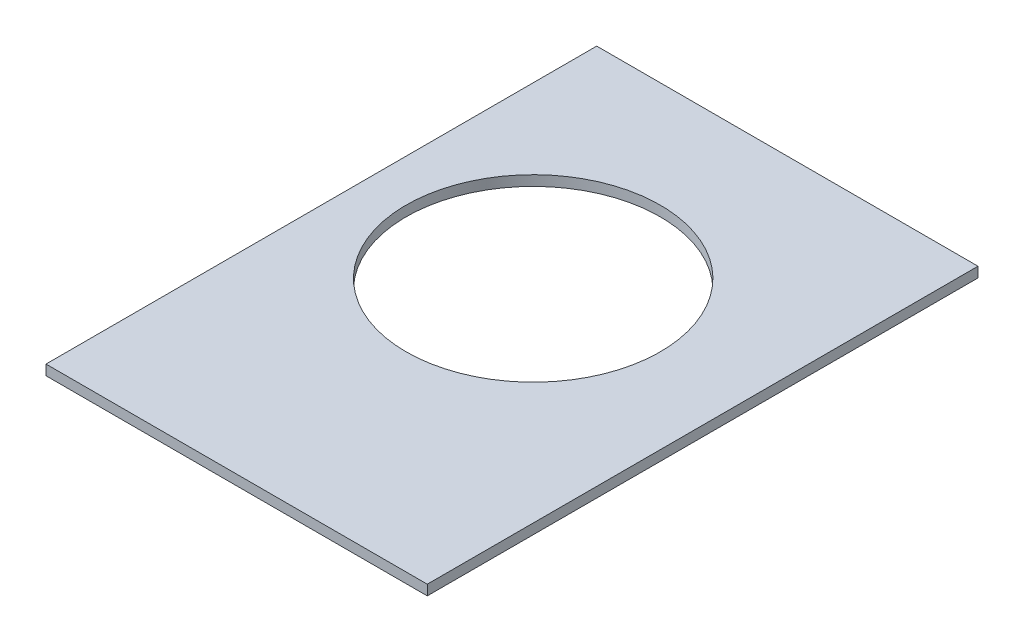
ISO-10303-21;
HEADER;
FILE_DESCRIPTION(('STEP AP214'),'2;1');
FILE_NAME('part.step','',(''),(''),'','','');
FILE_SCHEMA(('AUTOMOTIVE_DESIGN { 1 0 10303 214 1 1 1 1 }'));
ENDSEC;
DATA;
#1=APPLICATION_CONTEXT('core data for automotive mechanical design processes');
#2=APPLICATION_PROTOCOL_DEFINITION('international standard','automotive_design',2000,#1);
#3=PRODUCT_CONTEXT('',#1,'mechanical');
#4=PRODUCT('Part','Part','',(#3));
#5=PRODUCT_RELATED_PRODUCT_CATEGORY('part','',(#4));
#6=PRODUCT_DEFINITION_FORMATION('','',#4);
#7=PRODUCT_DEFINITION_CONTEXT('part definition',#1,'design');
#8=PRODUCT_DEFINITION('design','',#6,#7);
#9=PRODUCT_DEFINITION_SHAPE('','',#8);
#10=(LENGTH_UNIT() NAMED_UNIT(*) SI_UNIT(.MILLI.,.METRE.));
#11=(NAMED_UNIT(*) PLANE_ANGLE_UNIT() SI_UNIT($,.RADIAN.));
#12=(NAMED_UNIT(*) SI_UNIT($,.STERADIAN.) SOLID_ANGLE_UNIT());
#13=UNCERTAINTY_MEASURE_WITH_UNIT(LENGTH_MEASURE(1.E-05),#10,'distance_accuracy_value','');
#14=(GEOMETRIC_REPRESENTATION_CONTEXT(3) GLOBAL_UNCERTAINTY_ASSIGNED_CONTEXT((#13)) GLOBAL_UNIT_ASSIGNED_CONTEXT((#10,
#11,#12)) REPRESENTATION_CONTEXT('',''));
#15=CARTESIAN_POINT('',(0.,0.,0.));
#16=DIRECTION('',(0.,0.,1.));
#17=DIRECTION('',(1.,0.,0.));
#18=AXIS2_PLACEMENT_3D('',#15,#16,#17);
#19=CARTESIAN_POINT('',(0.,1.524,0.));
#20=DIRECTION('',(1.,0.,0.));
#21=DIRECTION('',(0.,0.,-1.));
#22=AXIS2_PLACEMENT_3D('',#19,#20,#21);
#23=PLANE('',#22);
#24=DIRECTION('',(0.,0.,1.));
#25=VECTOR('',#24,1.);
#26=CARTESIAN_POINT('',(0.,0.,0.));
#27=LINE('',#26,#25);
#28=CARTESIAN_POINT('',(0.,0.,-82.55));
#29=VERTEX_POINT('',#28);
#30=CARTESIAN_POINT('',(0.,0.,0.));
#31=VERTEX_POINT('',#30);
#32=EDGE_CURVE('E96',#29,#31,#27,.T.);
#33=ORIENTED_EDGE('',*,*,#32,.T.);
#34=DIRECTION('',(0.,-1.,0.));
#35=VECTOR('',#34,1.);
#36=CARTESIAN_POINT('',(0.,1.524,0.));
#37=LINE('',#36,#35);
#38=CARTESIAN_POINT('',(0.,1.524,0.));
#39=VERTEX_POINT('',#38);
#40=EDGE_CURVE('E11',#39,#31,#37,.T.);
#41=ORIENTED_EDGE('',*,*,#40,.F.);
#42=DIRECTION('',(0.,0.,1.));
#43=VECTOR('',#42,1.);
#44=CARTESIAN_POINT('',(0.,1.524,0.));
#45=LINE('',#44,#43);
#46=CARTESIAN_POINT('',(0.,1.524,-82.55));
#47=VERTEX_POINT('',#46);
#48=EDGE_CURVE('E84',#47,#39,#45,.T.);
#49=ORIENTED_EDGE('',*,*,#48,.F.);
#50=DIRECTION('',(0.,-1.,0.));
#51=VECTOR('',#50,1.);
#52=CARTESIAN_POINT('',(0.,1.524,-82.55));
#53=LINE('',#52,#51);
#54=EDGE_CURVE('E92',#47,#29,#53,.T.);
#55=ORIENTED_EDGE('',*,*,#54,.T.);
#56=EDGE_LOOP('',(#33,#41,#49,#55));
#57=FACE_BOUND('',#56,.T.);
#58=ADVANCED_FACE('F33',(#57),#23,.F.);
#59=CARTESIAN_POINT('',(0.,1.524,0.));
#60=DIRECTION('',(0.,0.,-1.));
#61=DIRECTION('',(-1.,0.,0.));
#62=AXIS2_PLACEMENT_3D('',#59,#60,#61);
#63=PLANE('',#62);
#64=DIRECTION('',(1.,0.,0.));
#65=VECTOR('',#64,1.);
#66=CARTESIAN_POINT('',(0.,0.,0.));
#67=LINE('',#66,#65);
#68=CARTESIAN_POINT('',(57.15,0.,0.));
#69=VERTEX_POINT('',#68);
#70=EDGE_CURVE('E88',#31,#69,#67,.T.);
#71=ORIENTED_EDGE('',*,*,#70,.T.);
#72=DIRECTION('',(0.,-1.,0.));
#73=VECTOR('',#72,1.);
#74=CARTESIAN_POINT('',(57.15,1.524,0.));
#75=LINE('',#74,#73);
#76=CARTESIAN_POINT('',(57.15,1.524,0.));
#77=VERTEX_POINT('',#76);
#78=EDGE_CURVE('E41',#77,#69,#75,.T.);
#79=ORIENTED_EDGE('',*,*,#78,.F.);
#80=DIRECTION('',(1.,0.,0.));
#81=VECTOR('',#80,1.);
#82=CARTESIAN_POINT('',(0.,1.524,0.));
#83=LINE('',#82,#81);
#84=EDGE_CURVE('E79',#39,#77,#83,.T.);
#85=ORIENTED_EDGE('',*,*,#84,.F.);
#86=ORIENTED_EDGE('',*,*,#40,.T.);
#87=EDGE_LOOP('',(#71,#79,#85,#86));
#88=FACE_BOUND('',#87,.T.);
#89=ADVANCED_FACE('F87',(#88),#63,.F.);
#90=CARTESIAN_POINT('',(57.15,1.524,0.));
#91=DIRECTION('',(-1.,0.,0.));
#92=DIRECTION('',(0.,0.,1.));
#93=AXIS2_PLACEMENT_3D('',#90,#91,#92);
#94=PLANE('',#93);
#95=DIRECTION('',(0.,0.,-1.));
#96=VECTOR('',#95,1.);
#97=CARTESIAN_POINT('',(57.15,0.,0.));
#98=LINE('',#97,#96);
#99=CARTESIAN_POINT('',(57.15,0.,-82.55));
#100=VERTEX_POINT('',#99);
#101=EDGE_CURVE('E66',#69,#100,#98,.T.);
#102=ORIENTED_EDGE('',*,*,#101,.T.);
#103=DIRECTION('',(0.,-1.,0.));
#104=VECTOR('',#103,1.);
#105=CARTESIAN_POINT('',(57.15,1.524,-82.55));
#106=LINE('',#105,#104);
#107=CARTESIAN_POINT('',(57.15,1.524,-82.55));
#108=VERTEX_POINT('',#107);
#109=EDGE_CURVE('E89',#108,#100,#106,.T.);
#110=ORIENTED_EDGE('',*,*,#109,.F.);
#111=DIRECTION('',(0.,0.,-1.));
#112=VECTOR('',#111,1.);
#113=CARTESIAN_POINT('',(57.15,1.524,0.));
#114=LINE('',#113,#112);
#115=EDGE_CURVE('E82',#77,#108,#114,.T.);
#116=ORIENTED_EDGE('',*,*,#115,.F.);
#117=ORIENTED_EDGE('',*,*,#78,.T.);
#118=EDGE_LOOP('',(#102,#110,#116,#117));
#119=FACE_BOUND('',#118,.T.);
#120=ADVANCED_FACE('F90',(#119),#94,.F.);
#121=CARTESIAN_POINT('',(0.,1.524,-82.55));
#122=DIRECTION('',(0.,0.,1.));
#123=DIRECTION('',(1.,0.,0.));
#124=AXIS2_PLACEMENT_3D('',#121,#122,#123);
#125=PLANE('',#124);
#126=DIRECTION('',(-1.,0.,0.));
#127=VECTOR('',#126,1.);
#128=CARTESIAN_POINT('',(0.,0.,-82.55));
#129=LINE('',#128,#127);
#130=EDGE_CURVE('E72',#100,#29,#129,.T.);
#131=ORIENTED_EDGE('',*,*,#130,.T.);
#132=ORIENTED_EDGE('',*,*,#54,.F.);
#133=DIRECTION('',(-1.,0.,0.));
#134=VECTOR('',#133,1.);
#135=CARTESIAN_POINT('',(0.,1.524,-82.55));
#136=LINE('',#135,#134);
#137=EDGE_CURVE('E49',#108,#47,#136,.T.);
#138=ORIENTED_EDGE('',*,*,#137,.F.);
#139=ORIENTED_EDGE('',*,*,#109,.T.);
#140=EDGE_LOOP('',(#131,#132,#138,#139));
#141=FACE_BOUND('',#140,.T.);
#142=ADVANCED_FACE('F104',(#141),#125,.F.);
#143=CARTESIAN_POINT('',(0.,1.524,0.));
#144=DIRECTION('',(0.,-1.,0.));
#145=DIRECTION('',(0.,0.,-1.));
#146=AXIS2_PLACEMENT_3D('',#143,#144,#145);
#147=PLANE('',#146);
#148=CARTESIAN_POINT('',(25.4,1.524,-47.625));
#149=DIRECTION('',(0.,-1.,0.));
#150=DIRECTION('',(0.,0.,-1.));
#151=AXIS2_PLACEMENT_3D('',#148,#149,#150);
#152=CIRCLE('',#151,19.05);
#153=CARTESIAN_POINT('',(25.4,1.524,-28.575));
#154=VERTEX_POINT('',#153);
#155=EDGE_CURVE('E99',#154,#154,#152,.T.);
#156=ORIENTED_EDGE('',*,*,#155,.T.);
#157=EDGE_LOOP('',(#156));
#158=FACE_BOUND('',#157,.T.);
#159=ORIENTED_EDGE('',*,*,#48,.T.);
#160=ORIENTED_EDGE('',*,*,#84,.T.);
#161=ORIENTED_EDGE('',*,*,#115,.T.);
#162=ORIENTED_EDGE('',*,*,#137,.T.);
#163=EDGE_LOOP('',(#159,#160,#161,#162));
#164=FACE_BOUND('',#163,.T.);
#165=ADVANCED_FACE('F80',(#158,#164),#147,.F.);
#166=CARTESIAN_POINT('',(0.,0.,0.));
#167=DIRECTION('',(0.,-1.,0.));
#168=DIRECTION('',(0.,0.,-1.));
#169=AXIS2_PLACEMENT_3D('',#166,#167,#168);
#170=PLANE('',#169);
#171=CARTESIAN_POINT('',(25.4,0.,-47.625));
#172=DIRECTION('',(0.,1.,0.));
#173=DIRECTION('',(0.,0.,1.));
#174=AXIS2_PLACEMENT_3D('',#171,#172,#173);
#175=CIRCLE('',#174,19.05);
#176=CARTESIAN_POINT('',(25.4,0.,-28.575));
#177=VERTEX_POINT('',#176);
#178=EDGE_CURVE('E112',#177,#177,#175,.T.);
#179=ORIENTED_EDGE('',*,*,#178,.T.);
#180=EDGE_LOOP('',(#179));
#181=FACE_BOUND('',#180,.T.);
#182=ORIENTED_EDGE('',*,*,#32,.F.);
#183=ORIENTED_EDGE('',*,*,#130,.F.);
#184=ORIENTED_EDGE('',*,*,#101,.F.);
#185=ORIENTED_EDGE('',*,*,#70,.F.);
#186=EDGE_LOOP('',(#182,#183,#184,#185));
#187=FACE_BOUND('',#186,.T.);
#188=ADVANCED_FACE('F107',(#181,#187),#170,.T.);
#189=CARTESIAN_POINT('',(25.4,0.,-47.625));
#190=DIRECTION('',(0.,1.,0.));
#191=DIRECTION('',(0.,0.,1.));
#192=AXIS2_PLACEMENT_3D('',#189,#190,#191);
#193=CYLINDRICAL_SURFACE('',#192,19.05);
#194=CARTESIAN_POINT('',(25.4,0.,-28.575));
#195=CARTESIAN_POINT('',(25.4,0.015875,-28.575));
#196=CARTESIAN_POINT('',(25.4,0.03175,-28.575));
#197=CARTESIAN_POINT('',(25.4,0.0635,-28.575));
#198=CARTESIAN_POINT('',(25.4,0.079375,-28.575));
#199=CARTESIAN_POINT('',(25.4,0.111125,-28.575));
#200=CARTESIAN_POINT('',(25.4,0.127,-28.575));
#201=CARTESIAN_POINT('',(25.4,0.15875,-28.575));
#202=CARTESIAN_POINT('',(25.4,0.174625,-28.575));
#203=CARTESIAN_POINT('',(25.4,0.206375,-28.575));
#204=CARTESIAN_POINT('',(25.4,0.22225,-28.575));
#205=CARTESIAN_POINT('',(25.4,0.254,-28.575));
#206=CARTESIAN_POINT('',(25.4,0.269875,-28.575));
#207=CARTESIAN_POINT('',(25.4,0.301625,-28.575));
#208=CARTESIAN_POINT('',(25.4,0.3175,-28.575));
#209=CARTESIAN_POINT('',(25.4,0.34925,-28.575));
#210=CARTESIAN_POINT('',(25.4,0.365125,-28.575));
#211=CARTESIAN_POINT('',(25.4,0.396875,-28.575));
#212=CARTESIAN_POINT('',(25.4,0.41275,-28.575));
#213=CARTESIAN_POINT('',(25.4,0.4445,-28.575));
#214=CARTESIAN_POINT('',(25.4,0.460375,-28.575));
#215=CARTESIAN_POINT('',(25.4,0.492125,-28.575));
#216=CARTESIAN_POINT('',(25.4,0.508,-28.575));
#217=CARTESIAN_POINT('',(25.4,0.53975,-28.575));
#218=CARTESIAN_POINT('',(25.4,0.555625,-28.575));
#219=CARTESIAN_POINT('',(25.4,0.587375,-28.575));
#220=CARTESIAN_POINT('',(25.4,0.60325,-28.575));
#221=CARTESIAN_POINT('',(25.4,0.635,-28.575));
#222=CARTESIAN_POINT('',(25.4,0.650875,-28.575));
#223=CARTESIAN_POINT('',(25.4,0.682625,-28.575));
#224=CARTESIAN_POINT('',(25.4,0.6985,-28.575));
#225=CARTESIAN_POINT('',(25.4,0.73025,-28.575));
#226=CARTESIAN_POINT('',(25.4,0.746125,-28.575));
#227=CARTESIAN_POINT('',(25.4,0.777875,-28.575));
#228=CARTESIAN_POINT('',(25.4,0.79375,-28.575));
#229=CARTESIAN_POINT('',(25.4,0.8255,-28.575));
#230=CARTESIAN_POINT('',(25.4,0.841375,-28.575));
#231=CARTESIAN_POINT('',(25.4,0.873125,-28.575));
#232=CARTESIAN_POINT('',(25.4,0.889,-28.575));
#233=CARTESIAN_POINT('',(25.4,0.92075,-28.575));
#234=CARTESIAN_POINT('',(25.4,0.936625,-28.575));
#235=CARTESIAN_POINT('',(25.4,0.968375,-28.575));
#236=CARTESIAN_POINT('',(25.4,0.98425,-28.575));
#237=CARTESIAN_POINT('',(25.4,1.016,-28.575));
#238=CARTESIAN_POINT('',(25.4,1.031875,-28.575));
#239=CARTESIAN_POINT('',(25.4,1.063625,-28.575));
#240=CARTESIAN_POINT('',(25.4,1.0795,-28.575));
#241=CARTESIAN_POINT('',(25.4,1.11125,-28.575));
#242=CARTESIAN_POINT('',(25.4,1.127125,-28.575));
#243=CARTESIAN_POINT('',(25.4,1.158875,-28.575));
#244=CARTESIAN_POINT('',(25.4,1.17475,-28.575));
#245=CARTESIAN_POINT('',(25.4,1.2065,-28.575));
#246=CARTESIAN_POINT('',(25.4,1.222375,-28.575));
#247=CARTESIAN_POINT('',(25.4,1.254125,-28.575));
#248=CARTESIAN_POINT('',(25.4,1.27,-28.575));
#249=CARTESIAN_POINT('',(25.4,1.30175,-28.575));
#250=CARTESIAN_POINT('',(25.4,1.317625,-28.575));
#251=CARTESIAN_POINT('',(25.4,1.349375,-28.575));
#252=CARTESIAN_POINT('',(25.4,1.36525,-28.575));
#253=CARTESIAN_POINT('',(25.4,1.397,-28.575));
#254=CARTESIAN_POINT('',(25.4,1.412875,-28.575));
#255=CARTESIAN_POINT('',(25.4,1.444625,-28.575));
#256=CARTESIAN_POINT('',(25.4,1.4605,-28.575));
#257=CARTESIAN_POINT('',(25.4,1.49225,-28.575));
#258=CARTESIAN_POINT('',(25.4,1.508125,-28.575));
#259=CARTESIAN_POINT('',(25.4,1.524,-28.575));
#260=B_SPLINE_CURVE_WITH_KNOTS('',3,(#194,#195,#196,#197,#198,#199,#200,#201,#202,#203,#204,
#205,#206,#207,#208,#209,#210,#211,#212,#213,#214,#215,#216,#217,#218,#219,#220,#221,#222,#223,
#224,#225,#226,#227,#228,#229,#230,#231,#232,#233,#234,#235,#236,#237,#238,#239,#240,#241,#242,
#243,#244,#245,#246,#247,#248,#249,#250,#251,#252,#253,#254,#255,#256,#257,#258,#259),
.UNSPECIFIED.,.F.,.F.,(4,2,2,2,2,2,2,2,2,2,2,2,2,2,2,2,2,2,2,2,2,2,2,2,2,2,2,2,2,2,2,2,4),(0.,
0.047625,0.09525,0.142875,0.1905,0.238125,0.28575,0.333375,0.381,0.428625,0.47625,0.523875,
0.5715,0.619125,0.66675,0.714375,0.762,0.809625,0.85725,0.904875,0.9525,1.000125,1.04775,
1.095375,1.143,1.190625,1.23825,1.285875,1.3335,1.381125,1.42875,1.476375,1.524),.UNSPECIFIED.);
#261=EDGE_CURVE('BSEAM117',#177,#154,#260,.T.);
#262=ORIENTED_EDGE('',*,*,#178,.F.);
#263=ORIENTED_EDGE('',*,*,#155,.F.);
#264=ORIENTED_EDGE('',*,*,#261,.T.);
#265=ORIENTED_EDGE('',*,*,#261,.F.);
#266=EDGE_LOOP('',(#262,#264,#263,#265));
#267=FACE_BOUND('',#266,.T.);
#268=ADVANCED_FACE('F117',(#267),#193,.F.);
#269=CLOSED_SHELL('',(#58,#89,#120,#142,#165,#188,#268));
#270=MANIFOLD_SOLID_BREP('B2',#269);
#271=ADVANCED_BREP_SHAPE_REPRESENTATION('',(#18,#270),#14);
#272=SHAPE_DEFINITION_REPRESENTATION(#9,#271);
ENDSEC;
END-ISO-10303-21;
